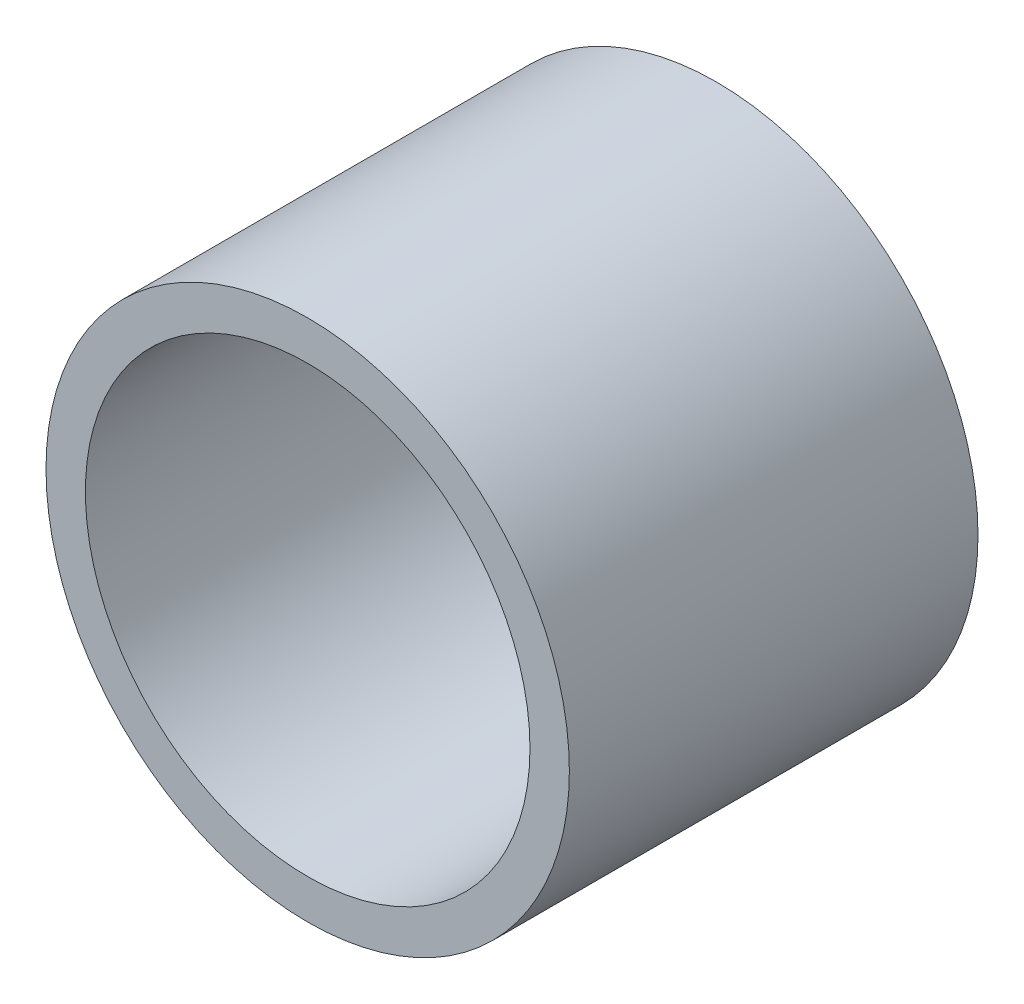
ISO-10303-21;
HEADER;
FILE_DESCRIPTION(('STEP AP214'),'2;1');
FILE_NAME('part.step','',(''),(''),'','','');
FILE_SCHEMA(('AUTOMOTIVE_DESIGN { 1 0 10303 214 1 1 1 1 }'));
ENDSEC;
DATA;
#1=APPLICATION_CONTEXT('core data for automotive mechanical design processes');
#2=APPLICATION_PROTOCOL_DEFINITION('international standard','automotive_design',2000,#1);
#3=PRODUCT_CONTEXT('',#1,'mechanical');
#4=PRODUCT('Part','Part','',(#3));
#5=PRODUCT_RELATED_PRODUCT_CATEGORY('part','',(#4));
#6=PRODUCT_DEFINITION_FORMATION('','',#4);
#7=PRODUCT_DEFINITION_CONTEXT('part definition',#1,'design');
#8=PRODUCT_DEFINITION('design','',#6,#7);
#9=PRODUCT_DEFINITION_SHAPE('','',#8);
#10=(LENGTH_UNIT() NAMED_UNIT(*) SI_UNIT(.MILLI.,.METRE.));
#11=(NAMED_UNIT(*) PLANE_ANGLE_UNIT() SI_UNIT($,.RADIAN.));
#12=(NAMED_UNIT(*) SI_UNIT($,.STERADIAN.) SOLID_ANGLE_UNIT());
#13=UNCERTAINTY_MEASURE_WITH_UNIT(LENGTH_MEASURE(1.E-05),#10,'distance_accuracy_value','');
#14=(GEOMETRIC_REPRESENTATION_CONTEXT(3) GLOBAL_UNCERTAINTY_ASSIGNED_CONTEXT((#13)) GLOBAL_UNIT_ASSIGNED_CONTEXT((#10,
#11,#12)) REPRESENTATION_CONTEXT('',''));
#15=CARTESIAN_POINT('',(0.,0.,0.));
#16=DIRECTION('',(0.,0.,1.));
#17=DIRECTION('',(1.,0.,0.));
#18=AXIS2_PLACEMENT_3D('',#15,#16,#17);
#19=CARTESIAN_POINT('',(0.,0.,0.));
#20=DIRECTION('',(0.,0.,1.));
#21=DIRECTION('',(1.,0.,0.));
#22=AXIS2_PLACEMENT_3D('',#19,#20,#21);
#23=CYLINDRICAL_SURFACE('',#22,34.);
#24=CARTESIAN_POINT('',(0.,0.,0.));
#25=DIRECTION('',(0.,0.,1.));
#26=DIRECTION('',(1.,0.,0.));
#27=AXIS2_PLACEMENT_3D('',#24,#25,#26);
#28=CIRCLE('',#27,34.);
#29=CARTESIAN_POINT('',(34.,0.,0.));
#30=VERTEX_POINT('',#29);
#31=EDGE_CURVE('E27',#30,#30,#28,.T.);
#32=ORIENTED_EDGE('',*,*,#31,.F.);
#33=EDGE_LOOP('',(#32));
#34=FACE_BOUND('',#33,.T.);
#35=CARTESIAN_POINT('',(0.,0.,62.5));
#36=DIRECTION('',(0.,0.,1.));
#37=DIRECTION('',(1.,0.,0.));
#38=AXIS2_PLACEMENT_3D('',#35,#36,#37);
#39=CIRCLE('',#38,34.);
#40=CARTESIAN_POINT('',(34.,0.,62.5));
#41=VERTEX_POINT('',#40);
#42=EDGE_CURVE('E18',#41,#41,#39,.T.);
#43=ORIENTED_EDGE('',*,*,#42,.T.);
#44=EDGE_LOOP('',(#43));
#45=FACE_BOUND('',#44,.T.);
#46=ADVANCED_FACE('F15',(#34,#45),#23,.F.);
#47=CARTESIAN_POINT('',(0.,0.,62.5));
#48=DIRECTION('',(0.,0.,-1.));
#49=DIRECTION('',(-1.,0.,0.));
#50=AXIS2_PLACEMENT_3D('',#47,#48,#49);
#51=PLANE('',#50);
#52=ORIENTED_EDGE('',*,*,#42,.F.);
#53=EDGE_LOOP('',(#52));
#54=FACE_BOUND('',#53,.T.);
#55=CARTESIAN_POINT('',(0.,0.,62.5));
#56=DIRECTION('',(0.,0.,1.));
#57=DIRECTION('',(1.,0.,0.));
#58=AXIS2_PLACEMENT_3D('',#55,#56,#57);
#59=CIRCLE('',#58,40.025);
#60=CARTESIAN_POINT('',(40.025,0.,62.5));
#61=VERTEX_POINT('',#60);
#62=EDGE_CURVE('E22',#61,#61,#59,.F.);
#63=ORIENTED_EDGE('',*,*,#62,.F.);
#64=EDGE_LOOP('',(#63));
#65=FACE_BOUND('',#64,.T.);
#66=ADVANCED_FACE('F36',(#54,#65),#51,.F.);
#67=CARTESIAN_POINT('',(0.,0.,0.));
#68=DIRECTION('',(0.,0.,-1.));
#69=DIRECTION('',(-1.,0.,0.));
#70=AXIS2_PLACEMENT_3D('',#67,#68,#69);
#71=PLANE('',#70);
#72=ORIENTED_EDGE('',*,*,#31,.T.);
#73=EDGE_LOOP('',(#72));
#74=FACE_BOUND('',#73,.T.);
#75=CARTESIAN_POINT('',(0.,0.,0.));
#76=DIRECTION('',(0.,0.,1.));
#77=DIRECTION('',(1.,0.,0.));
#78=AXIS2_PLACEMENT_3D('',#75,#76,#77);
#79=CIRCLE('',#78,40.025);
#80=CARTESIAN_POINT('',(40.025,0.,0.));
#81=VERTEX_POINT('',#80);
#82=EDGE_CURVE('E10',#81,#81,#79,.T.);
#83=ORIENTED_EDGE('',*,*,#82,.F.);
#84=EDGE_LOOP('',(#83));
#85=FACE_BOUND('',#84,.T.);
#86=ADVANCED_FACE('F39',(#74,#85),#71,.T.);
#87=CARTESIAN_POINT('',(0.,0.,0.));
#88=DIRECTION('',(0.,0.,1.));
#89=DIRECTION('',(1.,0.,0.));
#90=AXIS2_PLACEMENT_3D('',#87,#88,#89);
#91=CYLINDRICAL_SURFACE('',#90,40.025);
#92=ORIENTED_EDGE('',*,*,#82,.T.);
#93=EDGE_LOOP('',(#92));
#94=FACE_BOUND('',#93,.T.);
#95=ORIENTED_EDGE('',*,*,#62,.T.);
#96=EDGE_LOOP('',(#95));
#97=FACE_BOUND('',#96,.T.);
#98=ADVANCED_FACE('F42',(#94,#97),#91,.T.);
#99=CLOSED_SHELL('',(#46,#66,#86,#98));
#100=MANIFOLD_SOLID_BREP('B1',#99);
#101=ADVANCED_BREP_SHAPE_REPRESENTATION('',(#18,#100),#14);
#102=SHAPE_DEFINITION_REPRESENTATION(#9,#101);
ENDSEC;
END-ISO-10303-21;
